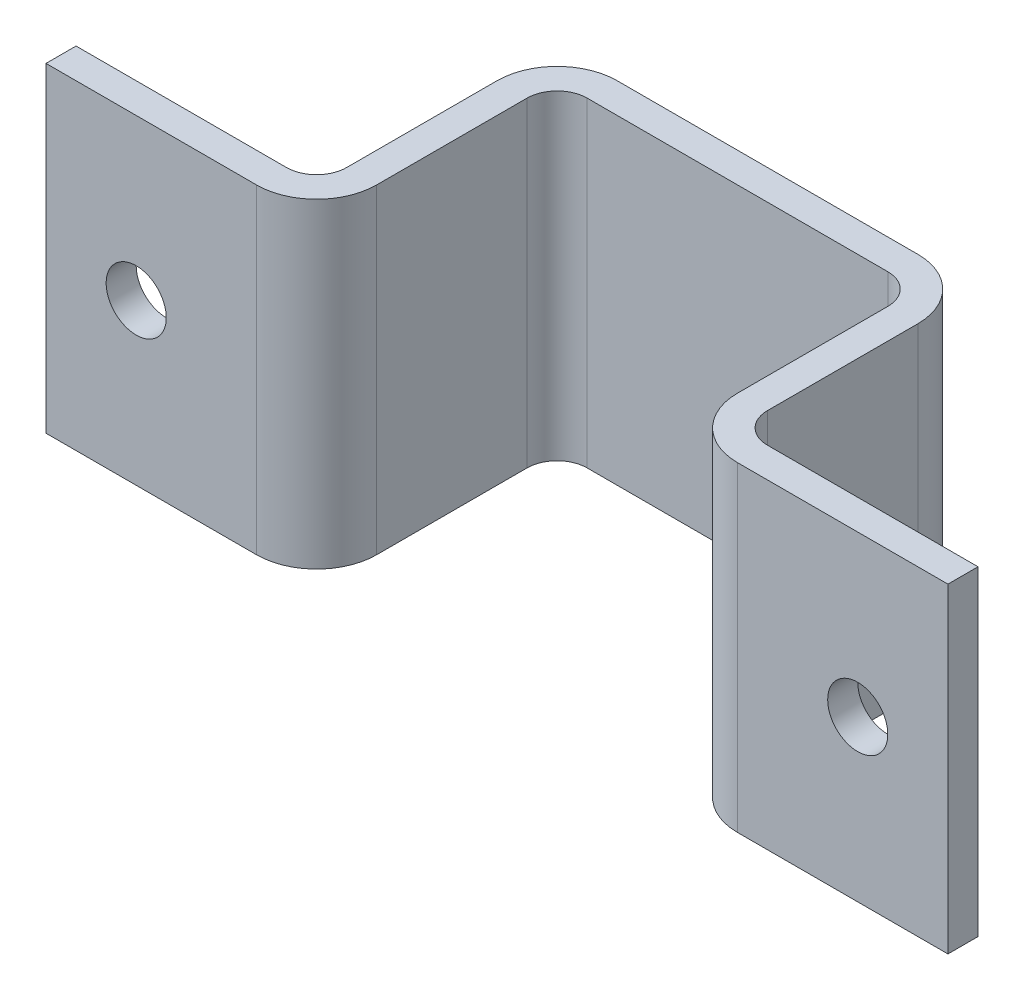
ISO-10303-21;
HEADER;
FILE_DESCRIPTION(('STEP AP214'),'2;1');
FILE_NAME('part.step','',(''),(''),'','','');
FILE_SCHEMA(('AUTOMOTIVE_DESIGN { 1 0 10303 214 1 1 1 1 }'));
ENDSEC;
DATA;
#1=APPLICATION_CONTEXT('core data for automotive mechanical design processes');
#2=APPLICATION_PROTOCOL_DEFINITION('international standard','automotive_design',2000,#1);
#3=PRODUCT_CONTEXT('',#1,'mechanical');
#4=PRODUCT('Part','Part','',(#3));
#5=PRODUCT_RELATED_PRODUCT_CATEGORY('part','',(#4));
#6=PRODUCT_DEFINITION_FORMATION('','',#4);
#7=PRODUCT_DEFINITION_CONTEXT('part definition',#1,'design');
#8=PRODUCT_DEFINITION('design','',#6,#7);
#9=PRODUCT_DEFINITION_SHAPE('','',#8);
#10=(LENGTH_UNIT() NAMED_UNIT(*) SI_UNIT(.MILLI.,.METRE.));
#11=(NAMED_UNIT(*) PLANE_ANGLE_UNIT() SI_UNIT($,.RADIAN.));
#12=(NAMED_UNIT(*) SI_UNIT($,.STERADIAN.) SOLID_ANGLE_UNIT());
#13=UNCERTAINTY_MEASURE_WITH_UNIT(LENGTH_MEASURE(1.E-05),#10,'distance_accuracy_value','');
#14=(GEOMETRIC_REPRESENTATION_CONTEXT(3) GLOBAL_UNCERTAINTY_ASSIGNED_CONTEXT((#13)) GLOBAL_UNIT_ASSIGNED_CONTEXT((#10,
#11,#12)) REPRESENTATION_CONTEXT('',''));
#15=CARTESIAN_POINT('',(0.,0.,0.));
#16=DIRECTION('',(0.,0.,1.));
#17=DIRECTION('',(1.,0.,0.));
#18=AXIS2_PLACEMENT_3D('',#15,#16,#17);
#19=CARTESIAN_POINT('',(-75.,26.6348483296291,-5.));
#20=DIRECTION('',(0.,0.,1.));
#21=DIRECTION('',(1.,0.,0.));
#22=AXIS2_PLACEMENT_3D('',#19,#20,#21);
#23=PLANE('',#22);
#24=CARTESIAN_POINT('',(-60.,0.,-5.));
#25=DIRECTION('',(0.,0.,-1.));
#26=DIRECTION('',(-1.,0.,0.));
#27=AXIS2_PLACEMENT_3D('',#24,#25,#26);
#28=CIRCLE('',#27,5.);
#29=CARTESIAN_POINT('',(-65.,0.,-5.));
#30=VERTEX_POINT('',#29);
#31=EDGE_CURVE('E412',#30,#30,#28,.T.);
#32=ORIENTED_EDGE('',*,*,#31,.F.);
#33=EDGE_LOOP('',(#32));
#34=FACE_BOUND('',#33,.T.);
#35=DIRECTION('',(1.,0.,0.));
#36=VECTOR('',#35,1.);
#37=CARTESIAN_POINT('',(-75.,-26.6348483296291,-5.));
#38=LINE('',#37,#36);
#39=CARTESIAN_POINT('',(-40.,-26.6348483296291,-5.));
#40=VERTEX_POINT('',#39);
#41=CARTESIAN_POINT('',(-75.,-26.6348483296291,-5.));
#42=VERTEX_POINT('',#41);
#43=EDGE_CURVE('E178',#40,#42,#38,.F.);
#44=ORIENTED_EDGE('',*,*,#43,.T.);
#45=DIRECTION('',(0.,-1.,0.));
#46=VECTOR('',#45,1.);
#47=CARTESIAN_POINT('',(-75.,26.6348483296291,-5.));
#48=LINE('',#47,#46);
#49=CARTESIAN_POINT('',(-75.,26.6348483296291,-5.));
#50=VERTEX_POINT('',#49);
#51=EDGE_CURVE('E11',#50,#42,#48,.T.);
#52=ORIENTED_EDGE('',*,*,#51,.F.);
#53=DIRECTION('',(1.,0.,0.));
#54=VECTOR('',#53,1.);
#55=CARTESIAN_POINT('',(-75.,26.6348483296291,-5.));
#56=LINE('',#55,#54);
#57=CARTESIAN_POINT('',(-40.,26.6348483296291,-5.));
#58=VERTEX_POINT('',#57);
#59=EDGE_CURVE('E234',#58,#50,#56,.F.);
#60=ORIENTED_EDGE('',*,*,#59,.F.);
#61=DIRECTION('',(0.,-1.,0.));
#62=VECTOR('',#61,1.);
#63=CARTESIAN_POINT('',(-40.,26.6348483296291,-5.));
#64=LINE('',#63,#62);
#65=EDGE_CURVE('E179',#58,#40,#64,.T.);
#66=ORIENTED_EDGE('',*,*,#65,.T.);
#67=EDGE_LOOP('',(#44,#52,#60,#66));
#68=FACE_BOUND('',#67,.T.);
#69=ADVANCED_FACE('F32',(#34,#68),#23,.F.);
#70=CARTESIAN_POINT('',(-75.,26.6348483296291,0.));
#71=DIRECTION('',(-1.,0.,0.));
#72=DIRECTION('',(0.,0.,1.));
#73=AXIS2_PLACEMENT_3D('',#70,#71,#72);
#74=PLANE('',#73);
#75=DIRECTION('',(0.,0.,-1.));
#76=VECTOR('',#75,1.);
#77=CARTESIAN_POINT('',(-75.,-26.6348483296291,0.));
#78=LINE('',#77,#76);
#79=CARTESIAN_POINT('',(-75.,-26.6348483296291,0.));
#80=VERTEX_POINT('',#79);
#81=EDGE_CURVE('E170',#80,#42,#78,.T.);
#82=ORIENTED_EDGE('',*,*,#81,.F.);
#83=DIRECTION('',(0.,-1.,0.));
#84=VECTOR('',#83,1.);
#85=CARTESIAN_POINT('',(-75.,26.6348483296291,0.));
#86=LINE('',#85,#84);
#87=CARTESIAN_POINT('',(-75.,26.6348483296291,0.));
#88=VERTEX_POINT('',#87);
#89=EDGE_CURVE('E39',#88,#80,#86,.T.);
#90=ORIENTED_EDGE('',*,*,#89,.F.);
#91=DIRECTION('',(0.,0.,-1.));
#92=VECTOR('',#91,1.);
#93=CARTESIAN_POINT('',(-75.,26.6348483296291,0.));
#94=LINE('',#93,#92);
#95=EDGE_CURVE('E173',#88,#50,#94,.T.);
#96=ORIENTED_EDGE('',*,*,#95,.T.);
#97=ORIENTED_EDGE('',*,*,#51,.T.);
#98=EDGE_LOOP('',(#82,#90,#96,#97));
#99=FACE_BOUND('',#98,.T.);
#100=ADVANCED_FACE('F168',(#99),#74,.T.);
#101=CARTESIAN_POINT('',(-75.,26.6348483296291,0.));
#102=DIRECTION('',(0.,0.,1.));
#103=DIRECTION('',(1.,0.,0.));
#104=AXIS2_PLACEMENT_3D('',#101,#102,#103);
#105=PLANE('',#104);
#106=CARTESIAN_POINT('',(-60.,0.,0.));
#107=DIRECTION('',(0.,0.,-1.));
#108=DIRECTION('',(-1.,0.,0.));
#109=AXIS2_PLACEMENT_3D('',#106,#107,#108);
#110=CIRCLE('',#109,5.);
#111=CARTESIAN_POINT('',(-65.,0.,0.));
#112=VERTEX_POINT('',#111);
#113=EDGE_CURVE('E182',#112,#112,#110,.T.);
#114=ORIENTED_EDGE('',*,*,#113,.T.);
#115=EDGE_LOOP('',(#114));
#116=FACE_BOUND('',#115,.T.);
#117=DIRECTION('',(-1.,0.,0.));
#118=VECTOR('',#117,1.);
#119=CARTESIAN_POINT('',(-75.,-26.6348483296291,0.));
#120=LINE('',#119,#118);
#121=CARTESIAN_POINT('',(-40.,-26.6348483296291,0.));
#122=VERTEX_POINT('',#121);
#123=EDGE_CURVE('E187',#122,#80,#120,.T.);
#124=ORIENTED_EDGE('',*,*,#123,.F.);
#125=DIRECTION('',(0.,-1.,0.));
#126=VECTOR('',#125,1.);
#127=CARTESIAN_POINT('',(-40.,26.6348483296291,0.));
#128=LINE('',#127,#126);
#129=CARTESIAN_POINT('',(-40.,26.6348483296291,0.));
#130=VERTEX_POINT('',#129);
#131=EDGE_CURVE('E321',#130,#122,#128,.T.);
#132=ORIENTED_EDGE('',*,*,#131,.F.);
#133=DIRECTION('',(-1.,0.,0.));
#134=VECTOR('',#133,1.);
#135=CARTESIAN_POINT('',(-75.,26.6348483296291,0.));
#136=LINE('',#135,#134);
#137=EDGE_CURVE('E237',#130,#88,#136,.T.);
#138=ORIENTED_EDGE('',*,*,#137,.T.);
#139=ORIENTED_EDGE('',*,*,#89,.T.);
#140=EDGE_LOOP('',(#124,#132,#138,#139));
#141=FACE_BOUND('',#140,.T.);
#142=ADVANCED_FACE('F323',(#116,#141),#105,.T.);
#143=CARTESIAN_POINT('',(-40.,26.6348483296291,-10.));
#144=DIRECTION('',(0.,-1.,0.));
#145=DIRECTION('',(0.,0.,-1.));
#146=AXIS2_PLACEMENT_3D('',#143,#144,#145);
#147=CYLINDRICAL_SURFACE('',#146,10.);
#148=CARTESIAN_POINT('',(-40.,-26.6348483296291,-10.));
#149=DIRECTION('',(0.,-1.,0.));
#150=DIRECTION('',(0.,0.,1.));
#151=AXIS2_PLACEMENT_3D('',#148,#149,#150);
#152=CIRCLE('',#151,10.);
#153=CARTESIAN_POINT('',(-30.,-26.6348483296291,-10.));
#154=VERTEX_POINT('',#153);
#155=EDGE_CURVE('E189',#154,#122,#152,.T.);
#156=ORIENTED_EDGE('',*,*,#155,.F.);
#157=DIRECTION('',(0.,-1.,0.));
#158=VECTOR('',#157,1.);
#159=CARTESIAN_POINT('',(-30.,26.6348483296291,-10.));
#160=LINE('',#159,#158);
#161=CARTESIAN_POINT('',(-30.,26.6348483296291,-10.));
#162=VERTEX_POINT('',#161);
#163=EDGE_CURVE('E319',#162,#154,#160,.T.);
#164=ORIENTED_EDGE('',*,*,#163,.F.);
#165=CARTESIAN_POINT('',(-40.,26.6348483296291,-10.));
#166=DIRECTION('',(0.,-1.,0.));
#167=DIRECTION('',(0.,0.,1.));
#168=AXIS2_PLACEMENT_3D('',#165,#166,#167);
#169=CIRCLE('',#168,10.);
#170=EDGE_CURVE('E240',#162,#130,#169,.T.);
#171=ORIENTED_EDGE('',*,*,#170,.T.);
#172=ORIENTED_EDGE('',*,*,#131,.T.);
#173=EDGE_LOOP('',(#156,#164,#171,#172));
#174=FACE_BOUND('',#173,.T.);
#175=ADVANCED_FACE('F330',(#174),#147,.T.);
#176=CARTESIAN_POINT('',(-30.,26.6348483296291,-10.));
#177=DIRECTION('',(1.,0.,0.));
#178=DIRECTION('',(0.,0.,-1.));
#179=AXIS2_PLACEMENT_3D('',#176,#177,#178);
#180=PLANE('',#179);
#181=DIRECTION('',(0.,0.,1.));
#182=VECTOR('',#181,1.);
#183=CARTESIAN_POINT('',(-30.,-26.6348483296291,-10.));
#184=LINE('',#183,#182);
#185=CARTESIAN_POINT('',(-30.,-26.6348483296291,-35.));
#186=VERTEX_POINT('',#185);
#187=EDGE_CURVE('E194',#186,#154,#184,.T.);
#188=ORIENTED_EDGE('',*,*,#187,.F.);
#189=DIRECTION('',(0.,-1.,0.));
#190=VECTOR('',#189,1.);
#191=CARTESIAN_POINT('',(-30.,26.6348483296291,-35.));
#192=LINE('',#191,#190);
#193=CARTESIAN_POINT('',(-30.,26.6348483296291,-35.));
#194=VERTEX_POINT('',#193);
#195=EDGE_CURVE('E317',#194,#186,#192,.T.);
#196=ORIENTED_EDGE('',*,*,#195,.F.);
#197=DIRECTION('',(0.,0.,1.));
#198=VECTOR('',#197,1.);
#199=CARTESIAN_POINT('',(-30.,26.6348483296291,-10.));
#200=LINE('',#199,#198);
#201=EDGE_CURVE('E243',#194,#162,#200,.T.);
#202=ORIENTED_EDGE('',*,*,#201,.T.);
#203=ORIENTED_EDGE('',*,*,#163,.T.);
#204=EDGE_LOOP('',(#188,#196,#202,#203));
#205=FACE_BOUND('',#204,.T.);
#206=ADVANCED_FACE('F333',(#205),#180,.T.);
#207=CARTESIAN_POINT('',(-25.,26.6348483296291,-35.));
#208=DIRECTION('',(0.,-1.,0.));
#209=DIRECTION('',(0.,0.,-1.));
#210=AXIS2_PLACEMENT_3D('',#207,#208,#209);
#211=CYLINDRICAL_SURFACE('',#210,5.);
#212=CARTESIAN_POINT('',(-25.,-26.6348483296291,-35.));
#213=DIRECTION('',(0.,1.,0.));
#214=DIRECTION('',(0.,0.,-1.));
#215=AXIS2_PLACEMENT_3D('',#212,#213,#214);
#216=CIRCLE('',#215,5.);
#217=CARTESIAN_POINT('',(-25.,-26.6348483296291,-40.));
#218=VERTEX_POINT('',#217);
#219=EDGE_CURVE('E197',#218,#186,#216,.T.);
#220=ORIENTED_EDGE('',*,*,#219,.F.);
#221=DIRECTION('',(0.,-1.,0.));
#222=VECTOR('',#221,1.);
#223=CARTESIAN_POINT('',(-25.,26.6348483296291,-40.));
#224=LINE('',#223,#222);
#225=CARTESIAN_POINT('',(-25.,26.6348483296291,-40.));
#226=VERTEX_POINT('',#225);
#227=EDGE_CURVE('E315',#226,#218,#224,.T.);
#228=ORIENTED_EDGE('',*,*,#227,.F.);
#229=CARTESIAN_POINT('',(-25.,26.6348483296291,-35.));
#230=DIRECTION('',(0.,1.,0.));
#231=DIRECTION('',(0.,0.,-1.));
#232=AXIS2_PLACEMENT_3D('',#229,#230,#231);
#233=CIRCLE('',#232,5.);
#234=EDGE_CURVE('E246',#226,#194,#233,.T.);
#235=ORIENTED_EDGE('',*,*,#234,.T.);
#236=ORIENTED_EDGE('',*,*,#195,.T.);
#237=EDGE_LOOP('',(#220,#228,#235,#236));
#238=FACE_BOUND('',#237,.T.);
#239=ADVANCED_FACE('F338',(#238),#211,.F.);
#240=CARTESIAN_POINT('',(-25.,26.6348483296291,-40.));
#241=DIRECTION('',(0.,0.,1.));
#242=DIRECTION('',(1.,0.,0.));
#243=AXIS2_PLACEMENT_3D('',#240,#241,#242);
#244=PLANE('',#243);
#245=DIRECTION('',(-1.,0.,0.));
#246=VECTOR('',#245,1.);
#247=CARTESIAN_POINT('',(-25.,-26.6348483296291,-40.));
#248=LINE('',#247,#246);
#249=CARTESIAN_POINT('',(25.,-26.6348483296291,-40.));
#250=VERTEX_POINT('',#249);
#251=EDGE_CURVE('E200',#250,#218,#248,.T.);
#252=ORIENTED_EDGE('',*,*,#251,.F.);
#253=DIRECTION('',(0.,-1.,0.));
#254=VECTOR('',#253,1.);
#255=CARTESIAN_POINT('',(25.,26.6348483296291,-40.));
#256=LINE('',#255,#254);
#257=CARTESIAN_POINT('',(25.,26.6348483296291,-40.));
#258=VERTEX_POINT('',#257);
#259=EDGE_CURVE('E313',#258,#250,#256,.T.);
#260=ORIENTED_EDGE('',*,*,#259,.F.);
#261=DIRECTION('',(-1.,0.,0.));
#262=VECTOR('',#261,1.);
#263=CARTESIAN_POINT('',(-25.,26.6348483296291,-40.));
#264=LINE('',#263,#262);
#265=EDGE_CURVE('E249',#258,#226,#264,.T.);
#266=ORIENTED_EDGE('',*,*,#265,.T.);
#267=ORIENTED_EDGE('',*,*,#227,.T.);
#268=EDGE_LOOP('',(#252,#260,#266,#267));
#269=FACE_BOUND('',#268,.T.);
#270=ADVANCED_FACE('F341',(#269),#244,.T.);
#271=CARTESIAN_POINT('',(25.,26.6348483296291,-35.));
#272=DIRECTION('',(0.,-1.,0.));
#273=DIRECTION('',(0.,0.,-1.));
#274=AXIS2_PLACEMENT_3D('',#271,#272,#273);
#275=CYLINDRICAL_SURFACE('',#274,5.);
#276=CARTESIAN_POINT('',(25.,-26.6348483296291,-35.));
#277=DIRECTION('',(0.,1.,0.));
#278=DIRECTION('',(0.,0.,-1.));
#279=AXIS2_PLACEMENT_3D('',#276,#277,#278);
#280=CIRCLE('',#279,5.);
#281=CARTESIAN_POINT('',(30.,-26.6348483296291,-35.));
#282=VERTEX_POINT('',#281);
#283=EDGE_CURVE('E203',#282,#250,#280,.T.);
#284=ORIENTED_EDGE('',*,*,#283,.F.);
#285=DIRECTION('',(0.,-1.,0.));
#286=VECTOR('',#285,1.);
#287=CARTESIAN_POINT('',(30.,26.6348483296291,-35.));
#288=LINE('',#287,#286);
#289=CARTESIAN_POINT('',(30.,26.6348483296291,-35.));
#290=VERTEX_POINT('',#289);
#291=EDGE_CURVE('E311',#290,#282,#288,.T.);
#292=ORIENTED_EDGE('',*,*,#291,.F.);
#293=CARTESIAN_POINT('',(25.,26.6348483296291,-35.));
#294=DIRECTION('',(0.,1.,0.));
#295=DIRECTION('',(0.,0.,-1.));
#296=AXIS2_PLACEMENT_3D('',#293,#294,#295);
#297=CIRCLE('',#296,5.);
#298=EDGE_CURVE('E252',#290,#258,#297,.T.);
#299=ORIENTED_EDGE('',*,*,#298,.T.);
#300=ORIENTED_EDGE('',*,*,#259,.T.);
#301=EDGE_LOOP('',(#284,#292,#299,#300));
#302=FACE_BOUND('',#301,.T.);
#303=ADVANCED_FACE('F346',(#302),#275,.F.);
#304=CARTESIAN_POINT('',(30.,26.6348483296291,-10.));
#305=DIRECTION('',(-1.,0.,0.));
#306=DIRECTION('',(0.,0.,1.));
#307=AXIS2_PLACEMENT_3D('',#304,#305,#306);
#308=PLANE('',#307);
#309=DIRECTION('',(0.,0.,-1.));
#310=VECTOR('',#309,1.);
#311=CARTESIAN_POINT('',(30.,-26.6348483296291,-10.));
#312=LINE('',#311,#310);
#313=CARTESIAN_POINT('',(30.,-26.6348483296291,-10.));
#314=VERTEX_POINT('',#313);
#315=EDGE_CURVE('E206',#314,#282,#312,.T.);
#316=ORIENTED_EDGE('',*,*,#315,.F.);
#317=DIRECTION('',(0.,-1.,0.));
#318=VECTOR('',#317,1.);
#319=CARTESIAN_POINT('',(30.,26.6348483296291,-10.));
#320=LINE('',#319,#318);
#321=CARTESIAN_POINT('',(30.,26.6348483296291,-10.));
#322=VERTEX_POINT('',#321);
#323=EDGE_CURVE('E309',#322,#314,#320,.T.);
#324=ORIENTED_EDGE('',*,*,#323,.F.);
#325=DIRECTION('',(0.,0.,-1.));
#326=VECTOR('',#325,1.);
#327=CARTESIAN_POINT('',(30.,26.6348483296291,-10.));
#328=LINE('',#327,#326);
#329=EDGE_CURVE('E255',#322,#290,#328,.T.);
#330=ORIENTED_EDGE('',*,*,#329,.T.);
#331=ORIENTED_EDGE('',*,*,#291,.T.);
#332=EDGE_LOOP('',(#316,#324,#330,#331));
#333=FACE_BOUND('',#332,.T.);
#334=ADVANCED_FACE('F349',(#333),#308,.T.);
#335=CARTESIAN_POINT('',(40.,26.6348483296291,-10.));
#336=DIRECTION('',(0.,-1.,0.));
#337=DIRECTION('',(0.,0.,-1.));
#338=AXIS2_PLACEMENT_3D('',#335,#336,#337);
#339=CYLINDRICAL_SURFACE('',#338,9.99999999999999);
#340=CARTESIAN_POINT('',(40.,-26.6348483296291,-10.));
#341=DIRECTION('',(0.,-1.,0.));
#342=DIRECTION('',(0.,0.,1.));
#343=AXIS2_PLACEMENT_3D('',#340,#341,#342);
#344=CIRCLE('',#343,9.99999999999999);
#345=CARTESIAN_POINT('',(40.,-26.6348483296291,0.));
#346=VERTEX_POINT('',#345);
#347=EDGE_CURVE('E209',#346,#314,#344,.T.);
#348=ORIENTED_EDGE('',*,*,#347,.F.);
#349=DIRECTION('',(0.,-1.,0.));
#350=VECTOR('',#349,1.);
#351=CARTESIAN_POINT('',(40.,26.6348483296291,0.));
#352=LINE('',#351,#350);
#353=CARTESIAN_POINT('',(40.,26.6348483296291,0.));
#354=VERTEX_POINT('',#353);
#355=EDGE_CURVE('E307',#354,#346,#352,.T.);
#356=ORIENTED_EDGE('',*,*,#355,.F.);
#357=CARTESIAN_POINT('',(40.,26.6348483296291,-10.));
#358=DIRECTION('',(0.,-1.,0.));
#359=DIRECTION('',(0.,0.,1.));
#360=AXIS2_PLACEMENT_3D('',#357,#358,#359);
#361=CIRCLE('',#360,9.99999999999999);
#362=EDGE_CURVE('E258',#354,#322,#361,.T.);
#363=ORIENTED_EDGE('',*,*,#362,.T.);
#364=ORIENTED_EDGE('',*,*,#323,.T.);
#365=EDGE_LOOP('',(#348,#356,#363,#364));
#366=FACE_BOUND('',#365,.T.);
#367=ADVANCED_FACE('F354',(#366),#339,.T.);
#368=CARTESIAN_POINT('',(75.,26.6348483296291,0.));
#369=DIRECTION('',(0.,0.,1.));
#370=DIRECTION('',(1.,0.,0.));
#371=AXIS2_PLACEMENT_3D('',#368,#369,#370);
#372=PLANE('',#371);
#373=CARTESIAN_POINT('',(60.,0.,0.));
#374=DIRECTION('',(0.,0.,-1.));
#375=DIRECTION('',(-1.,0.,0.));
#376=AXIS2_PLACEMENT_3D('',#373,#374,#375);
#377=CIRCLE('',#376,5.);
#378=CARTESIAN_POINT('',(55.,0.,0.));
#379=VERTEX_POINT('',#378);
#380=EDGE_CURVE('E414',#379,#379,#377,.T.);
#381=ORIENTED_EDGE('',*,*,#380,.T.);
#382=EDGE_LOOP('',(#381));
#383=FACE_BOUND('',#382,.T.);
#384=DIRECTION('',(-1.,0.,0.));
#385=VECTOR('',#384,1.);
#386=CARTESIAN_POINT('',(75.,-26.6348483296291,0.));
#387=LINE('',#386,#385);
#388=CARTESIAN_POINT('',(75.,-26.6348483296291,0.));
#389=VERTEX_POINT('',#388);
#390=EDGE_CURVE('E212',#389,#346,#387,.T.);
#391=ORIENTED_EDGE('',*,*,#390,.F.);
#392=DIRECTION('',(0.,-1.,0.));
#393=VECTOR('',#392,1.);
#394=CARTESIAN_POINT('',(75.,26.6348483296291,0.));
#395=LINE('',#394,#393);
#396=CARTESIAN_POINT('',(75.,26.6348483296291,0.));
#397=VERTEX_POINT('',#396);
#398=EDGE_CURVE('E305',#397,#389,#395,.T.);
#399=ORIENTED_EDGE('',*,*,#398,.F.);
#400=DIRECTION('',(-1.,0.,0.));
#401=VECTOR('',#400,1.);
#402=CARTESIAN_POINT('',(75.,26.6348483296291,0.));
#403=LINE('',#402,#401);
#404=EDGE_CURVE('E261',#397,#354,#403,.T.);
#405=ORIENTED_EDGE('',*,*,#404,.T.);
#406=ORIENTED_EDGE('',*,*,#355,.T.);
#407=EDGE_LOOP('',(#391,#399,#405,#406));
#408=FACE_BOUND('',#407,.T.);
#409=ADVANCED_FACE('F357',(#383,#408),#372,.T.);
#410=CARTESIAN_POINT('',(75.,26.6348483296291,-5.00000000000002));
#411=DIRECTION('',(1.,0.,0.));
#412=DIRECTION('',(0.,0.,-1.));
#413=AXIS2_PLACEMENT_3D('',#410,#411,#412);
#414=PLANE('',#413);
#415=DIRECTION('',(0.,0.,1.));
#416=VECTOR('',#415,1.);
#417=CARTESIAN_POINT('',(75.,-26.6348483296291,-5.00000000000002));
#418=LINE('',#417,#416);
#419=CARTESIAN_POINT('',(75.,-26.6348483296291,-5.00000000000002));
#420=VERTEX_POINT('',#419);
#421=EDGE_CURVE('E215',#420,#389,#418,.T.);
#422=ORIENTED_EDGE('',*,*,#421,.F.);
#423=DIRECTION('',(0.,-1.,0.));
#424=VECTOR('',#423,1.);
#425=CARTESIAN_POINT('',(75.,26.6348483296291,-5.00000000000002));
#426=LINE('',#425,#424);
#427=CARTESIAN_POINT('',(75.,26.6348483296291,-5.00000000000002));
#428=VERTEX_POINT('',#427);
#429=EDGE_CURVE('E303',#428,#420,#426,.T.);
#430=ORIENTED_EDGE('',*,*,#429,.F.);
#431=DIRECTION('',(0.,0.,1.));
#432=VECTOR('',#431,1.);
#433=CARTESIAN_POINT('',(75.,26.6348483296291,-5.00000000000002));
#434=LINE('',#433,#432);
#435=EDGE_CURVE('E264',#428,#397,#434,.T.);
#436=ORIENTED_EDGE('',*,*,#435,.T.);
#437=ORIENTED_EDGE('',*,*,#398,.T.);
#438=EDGE_LOOP('',(#422,#430,#436,#437));
#439=FACE_BOUND('',#438,.T.);
#440=ADVANCED_FACE('F361',(#439),#414,.T.);
#441=CARTESIAN_POINT('',(75.,26.6348483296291,-5.00000000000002));
#442=DIRECTION('',(0.,0.,1.));
#443=DIRECTION('',(1.,0.,0.));
#444=AXIS2_PLACEMENT_3D('',#441,#442,#443);
#445=PLANE('',#444);
#446=CARTESIAN_POINT('',(60.,0.,-5.));
#447=DIRECTION('',(0.,0.,-1.));
#448=DIRECTION('',(-1.,0.,0.));
#449=AXIS2_PLACEMENT_3D('',#446,#447,#448);
#450=CIRCLE('',#449,5.);
#451=CARTESIAN_POINT('',(55.,0.,-5.));
#452=VERTEX_POINT('',#451);
#453=EDGE_CURVE('E418',#452,#452,#450,.T.);
#454=ORIENTED_EDGE('',*,*,#453,.F.);
#455=EDGE_LOOP('',(#454));
#456=FACE_BOUND('',#455,.T.);
#457=DIRECTION('',(-1.,0.,0.));
#458=VECTOR('',#457,1.);
#459=CARTESIAN_POINT('',(75.,-26.6348483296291,-5.00000000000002));
#460=LINE('',#459,#458);
#461=CARTESIAN_POINT('',(40.,-26.6348483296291,-5.00000000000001));
#462=VERTEX_POINT('',#461);
#463=EDGE_CURVE('E218',#420,#462,#460,.T.);
#464=ORIENTED_EDGE('',*,*,#463,.T.);
#465=DIRECTION('',(0.,-1.,0.));
#466=VECTOR('',#465,1.);
#467=CARTESIAN_POINT('',(40.,26.6348483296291,-5.00000000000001));
#468=LINE('',#467,#466);
#469=CARTESIAN_POINT('',(40.,26.6348483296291,-5.00000000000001));
#470=VERTEX_POINT('',#469);
#471=EDGE_CURVE('E300',#470,#462,#468,.T.);
#472=ORIENTED_EDGE('',*,*,#471,.F.);
#473=DIRECTION('',(-1.,0.,0.));
#474=VECTOR('',#473,1.);
#475=CARTESIAN_POINT('',(75.,26.6348483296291,-5.00000000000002));
#476=LINE('',#475,#474);
#477=EDGE_CURVE('E267',#428,#470,#476,.T.);
#478=ORIENTED_EDGE('',*,*,#477,.F.);
#479=ORIENTED_EDGE('',*,*,#429,.T.);
#480=EDGE_LOOP('',(#464,#472,#478,#479));
#481=FACE_BOUND('',#480,.T.);
#482=ADVANCED_FACE('F366',(#456,#481),#445,.F.);
#483=CARTESIAN_POINT('',(40.,26.6348483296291,-10.));
#484=DIRECTION('',(0.,-1.,0.));
#485=DIRECTION('',(0.,0.,-1.));
#486=AXIS2_PLACEMENT_3D('',#483,#484,#485);
#487=CYLINDRICAL_SURFACE('',#486,4.99999999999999);
#488=CARTESIAN_POINT('',(40.,-26.6348483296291,-10.));
#489=DIRECTION('',(0.,1.,0.));
#490=DIRECTION('',(1.,0.,0.));
#491=AXIS2_PLACEMENT_3D('',#488,#489,#490);
#492=CIRCLE('',#491,4.99999999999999);
#493=CARTESIAN_POINT('',(35.,-26.6348483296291,-10.));
#494=VERTEX_POINT('',#493);
#495=EDGE_CURVE('E220',#462,#494,#492,.F.);
#496=ORIENTED_EDGE('',*,*,#495,.T.);
#497=DIRECTION('',(0.,-1.,0.));
#498=VECTOR('',#497,1.);
#499=CARTESIAN_POINT('',(35.,26.6348483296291,-10.));
#500=LINE('',#499,#498);
#501=CARTESIAN_POINT('',(35.,26.6348483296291,-10.));
#502=VERTEX_POINT('',#501);
#503=EDGE_CURVE('E297',#502,#494,#500,.T.);
#504=ORIENTED_EDGE('',*,*,#503,.F.);
#505=CARTESIAN_POINT('',(40.,26.6348483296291,-10.));
#506=DIRECTION('',(0.,1.,0.));
#507=DIRECTION('',(1.,0.,0.));
#508=AXIS2_PLACEMENT_3D('',#505,#506,#507);
#509=CIRCLE('',#508,4.99999999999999);
#510=EDGE_CURVE('E269',#470,#502,#509,.F.);
#511=ORIENTED_EDGE('',*,*,#510,.F.);
#512=ORIENTED_EDGE('',*,*,#471,.T.);
#513=EDGE_LOOP('',(#496,#504,#511,#512));
#514=FACE_BOUND('',#513,.T.);
#515=ADVANCED_FACE('F372',(#514),#487,.F.);
#516=CARTESIAN_POINT('',(35.,26.6348483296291,-10.));
#517=DIRECTION('',(-1.,0.,0.));
#518=DIRECTION('',(0.,0.,1.));
#519=AXIS2_PLACEMENT_3D('',#516,#517,#518);
#520=PLANE('',#519);
#521=DIRECTION('',(0.,0.,-1.));
#522=VECTOR('',#521,1.);
#523=CARTESIAN_POINT('',(35.,-26.6348483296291,-10.));
#524=LINE('',#523,#522);
#525=CARTESIAN_POINT('',(35.,-26.6348483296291,-35.));
#526=VERTEX_POINT('',#525);
#527=EDGE_CURVE('E222',#494,#526,#524,.T.);
#528=ORIENTED_EDGE('',*,*,#527,.T.);
#529=DIRECTION('',(0.,-1.,0.));
#530=VECTOR('',#529,1.);
#531=CARTESIAN_POINT('',(35.,26.6348483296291,-35.));
#532=LINE('',#531,#530);
#533=CARTESIAN_POINT('',(35.,26.6348483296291,-35.));
#534=VERTEX_POINT('',#533);
#535=EDGE_CURVE('E294',#534,#526,#532,.T.);
#536=ORIENTED_EDGE('',*,*,#535,.F.);
#537=DIRECTION('',(0.,0.,-1.));
#538=VECTOR('',#537,1.);
#539=CARTESIAN_POINT('',(35.,26.6348483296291,-10.));
#540=LINE('',#539,#538);
#541=EDGE_CURVE('E271',#502,#534,#540,.T.);
#542=ORIENTED_EDGE('',*,*,#541,.F.);
#543=ORIENTED_EDGE('',*,*,#503,.T.);
#544=EDGE_LOOP('',(#528,#536,#542,#543));
#545=FACE_BOUND('',#544,.T.);
#546=ADVANCED_FACE('F376',(#545),#520,.F.);
#547=CARTESIAN_POINT('',(25.,26.6348483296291,-35.));
#548=DIRECTION('',(0.,-1.,0.));
#549=DIRECTION('',(0.,0.,-1.));
#550=AXIS2_PLACEMENT_3D('',#547,#548,#549);
#551=CYLINDRICAL_SURFACE('',#550,9.99999999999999);
#552=CARTESIAN_POINT('',(25.,-26.6348483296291,-35.));
#553=DIRECTION('',(0.,1.,0.));
#554=DIRECTION('',(1.,0.,0.));
#555=AXIS2_PLACEMENT_3D('',#552,#553,#554);
#556=CIRCLE('',#555,9.99999999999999);
#557=CARTESIAN_POINT('',(25.,-26.6348483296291,-45.));
#558=VERTEX_POINT('',#557);
#559=EDGE_CURVE('E224',#526,#558,#556,.T.);
#560=ORIENTED_EDGE('',*,*,#559,.T.);
#561=DIRECTION('',(0.,-1.,0.));
#562=VECTOR('',#561,1.);
#563=CARTESIAN_POINT('',(25.,26.6348483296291,-45.));
#564=LINE('',#563,#562);
#565=CARTESIAN_POINT('',(25.,26.6348483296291,-45.));
#566=VERTEX_POINT('',#565);
#567=EDGE_CURVE('E291',#566,#558,#564,.T.);
#568=ORIENTED_EDGE('',*,*,#567,.F.);
#569=CARTESIAN_POINT('',(25.,26.6348483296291,-35.));
#570=DIRECTION('',(0.,1.,0.));
#571=DIRECTION('',(1.,0.,0.));
#572=AXIS2_PLACEMENT_3D('',#569,#570,#571);
#573=CIRCLE('',#572,9.99999999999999);
#574=EDGE_CURVE('E273',#534,#566,#573,.T.);
#575=ORIENTED_EDGE('',*,*,#574,.F.);
#576=ORIENTED_EDGE('',*,*,#535,.T.);
#577=EDGE_LOOP('',(#560,#568,#575,#576));
#578=FACE_BOUND('',#577,.T.);
#579=ADVANCED_FACE('F381',(#578),#551,.T.);
#580=CARTESIAN_POINT('',(-25.,26.6348483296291,-45.));
#581=DIRECTION('',(0.,0.,1.));
#582=DIRECTION('',(1.,0.,0.));
#583=AXIS2_PLACEMENT_3D('',#580,#581,#582);
#584=PLANE('',#583);
#585=DIRECTION('',(1.,0.,0.));
#586=VECTOR('',#585,1.);
#587=CARTESIAN_POINT('',(-25.,-26.6348483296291,-45.));
#588=LINE('',#587,#586);
#589=CARTESIAN_POINT('',(-25.,-26.6348483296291,-45.));
#590=VERTEX_POINT('',#589);
#591=EDGE_CURVE('E226',#558,#590,#588,.F.);
#592=ORIENTED_EDGE('',*,*,#591,.T.);
#593=DIRECTION('',(0.,-1.,0.));
#594=VECTOR('',#593,1.);
#595=CARTESIAN_POINT('',(-25.,26.6348483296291,-45.));
#596=LINE('',#595,#594);
#597=CARTESIAN_POINT('',(-25.,26.6348483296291,-45.));
#598=VERTEX_POINT('',#597);
#599=EDGE_CURVE('E288',#598,#590,#596,.T.);
#600=ORIENTED_EDGE('',*,*,#599,.F.);
#601=DIRECTION('',(1.,0.,0.));
#602=VECTOR('',#601,1.);
#603=CARTESIAN_POINT('',(-25.,26.6348483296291,-45.));
#604=LINE('',#603,#602);
#605=EDGE_CURVE('E275',#566,#598,#604,.F.);
#606=ORIENTED_EDGE('',*,*,#605,.F.);
#607=ORIENTED_EDGE('',*,*,#567,.T.);
#608=EDGE_LOOP('',(#592,#600,#606,#607));
#609=FACE_BOUND('',#608,.T.);
#610=ADVANCED_FACE('F387',(#609),#584,.F.);
#611=CARTESIAN_POINT('',(-25.,26.6348483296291,-35.));
#612=DIRECTION('',(0.,-1.,0.));
#613=DIRECTION('',(0.,0.,-1.));
#614=AXIS2_PLACEMENT_3D('',#611,#612,#613);
#615=CYLINDRICAL_SURFACE('',#614,9.99999999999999);
#616=CARTESIAN_POINT('',(-25.,-26.6348483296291,-35.));
#617=DIRECTION('',(0.,1.,0.));
#618=DIRECTION('',(1.,0.,0.));
#619=AXIS2_PLACEMENT_3D('',#616,#617,#618);
#620=CIRCLE('',#619,9.99999999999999);
#621=CARTESIAN_POINT('',(-35.,-26.6348483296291,-35.));
#622=VERTEX_POINT('',#621);
#623=EDGE_CURVE('E228',#590,#622,#620,.T.);
#624=ORIENTED_EDGE('',*,*,#623,.T.);
#625=DIRECTION('',(0.,-1.,0.));
#626=VECTOR('',#625,1.);
#627=CARTESIAN_POINT('',(-35.,26.6348483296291,-35.));
#628=LINE('',#627,#626);
#629=CARTESIAN_POINT('',(-35.,26.6348483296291,-35.));
#630=VERTEX_POINT('',#629);
#631=EDGE_CURVE('E285',#630,#622,#628,.T.);
#632=ORIENTED_EDGE('',*,*,#631,.F.);
#633=CARTESIAN_POINT('',(-25.,26.6348483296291,-35.));
#634=DIRECTION('',(0.,1.,0.));
#635=DIRECTION('',(1.,0.,0.));
#636=AXIS2_PLACEMENT_3D('',#633,#634,#635);
#637=CIRCLE('',#636,9.99999999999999);
#638=EDGE_CURVE('E277',#598,#630,#637,.T.);
#639=ORIENTED_EDGE('',*,*,#638,.F.);
#640=ORIENTED_EDGE('',*,*,#599,.T.);
#641=EDGE_LOOP('',(#624,#632,#639,#640));
#642=FACE_BOUND('',#641,.T.);
#643=ADVANCED_FACE('F391',(#642),#615,.T.);
#644=CARTESIAN_POINT('',(-35.,26.6348483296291,-10.));
#645=DIRECTION('',(1.,0.,0.));
#646=DIRECTION('',(0.,0.,-1.));
#647=AXIS2_PLACEMENT_3D('',#644,#645,#646);
#648=PLANE('',#647);
#649=DIRECTION('',(0.,0.,-1.));
#650=VECTOR('',#649,1.);
#651=CARTESIAN_POINT('',(-35.,-26.6348483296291,-10.));
#652=LINE('',#651,#650);
#653=CARTESIAN_POINT('',(-35.,-26.6348483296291,-10.));
#654=VERTEX_POINT('',#653);
#655=EDGE_CURVE('E230',#622,#654,#652,.F.);
#656=ORIENTED_EDGE('',*,*,#655,.T.);
#657=DIRECTION('',(0.,-1.,0.));
#658=VECTOR('',#657,1.);
#659=CARTESIAN_POINT('',(-35.,26.6348483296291,-10.));
#660=LINE('',#659,#658);
#661=CARTESIAN_POINT('',(-35.,26.6348483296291,-10.));
#662=VERTEX_POINT('',#661);
#663=EDGE_CURVE('E282',#662,#654,#660,.T.);
#664=ORIENTED_EDGE('',*,*,#663,.F.);
#665=DIRECTION('',(0.,0.,-1.));
#666=VECTOR('',#665,1.);
#667=CARTESIAN_POINT('',(-35.,26.6348483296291,-10.));
#668=LINE('',#667,#666);
#669=EDGE_CURVE('E51',#630,#662,#668,.F.);
#670=ORIENTED_EDGE('',*,*,#669,.F.);
#671=ORIENTED_EDGE('',*,*,#631,.T.);
#672=EDGE_LOOP('',(#656,#664,#670,#671));
#673=FACE_BOUND('',#672,.T.);
#674=ADVANCED_FACE('F394',(#673),#648,.F.);
#675=CARTESIAN_POINT('',(-40.,26.6348483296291,-10.));
#676=DIRECTION('',(0.,-1.,0.));
#677=DIRECTION('',(0.,0.,-1.));
#678=AXIS2_PLACEMENT_3D('',#675,#676,#677);
#679=CYLINDRICAL_SURFACE('',#678,5.);
#680=CARTESIAN_POINT('',(-40.,-26.6348483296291,-10.));
#681=DIRECTION('',(0.,1.,0.));
#682=DIRECTION('',(1.,0.,0.));
#683=AXIS2_PLACEMENT_3D('',#680,#681,#682);
#684=CIRCLE('',#683,5.);
#685=EDGE_CURVE('E232',#654,#40,#684,.F.);
#686=ORIENTED_EDGE('',*,*,#685,.T.);
#687=ORIENTED_EDGE('',*,*,#65,.F.);
#688=CARTESIAN_POINT('',(-40.,26.6348483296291,-10.));
#689=DIRECTION('',(0.,1.,0.));
#690=DIRECTION('',(1.,0.,0.));
#691=AXIS2_PLACEMENT_3D('',#688,#689,#690);
#692=CIRCLE('',#691,5.);
#693=EDGE_CURVE('E46',#662,#58,#692,.F.);
#694=ORIENTED_EDGE('',*,*,#693,.F.);
#695=ORIENTED_EDGE('',*,*,#663,.T.);
#696=EDGE_LOOP('',(#686,#687,#694,#695));
#697=FACE_BOUND('',#696,.T.);
#698=ADVANCED_FACE('F396',(#697),#679,.F.);
#699=CARTESIAN_POINT('',(-40.,26.6348483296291,-10.));
#700=DIRECTION('',(0.,-1.,0.));
#701=DIRECTION('',(0.,0.,-1.));
#702=AXIS2_PLACEMENT_3D('',#699,#700,#701);
#703=PLANE('',#702);
#704=ORIENTED_EDGE('',*,*,#59,.T.);
#705=ORIENTED_EDGE('',*,*,#95,.F.);
#706=ORIENTED_EDGE('',*,*,#137,.F.);
#707=ORIENTED_EDGE('',*,*,#170,.F.);
#708=ORIENTED_EDGE('',*,*,#201,.F.);
#709=ORIENTED_EDGE('',*,*,#234,.F.);
#710=ORIENTED_EDGE('',*,*,#265,.F.);
#711=ORIENTED_EDGE('',*,*,#298,.F.);
#712=ORIENTED_EDGE('',*,*,#329,.F.);
#713=ORIENTED_EDGE('',*,*,#362,.F.);
#714=ORIENTED_EDGE('',*,*,#404,.F.);
#715=ORIENTED_EDGE('',*,*,#435,.F.);
#716=ORIENTED_EDGE('',*,*,#477,.T.);
#717=ORIENTED_EDGE('',*,*,#510,.T.);
#718=ORIENTED_EDGE('',*,*,#541,.T.);
#719=ORIENTED_EDGE('',*,*,#574,.T.);
#720=ORIENTED_EDGE('',*,*,#605,.T.);
#721=ORIENTED_EDGE('',*,*,#638,.T.);
#722=ORIENTED_EDGE('',*,*,#669,.T.);
#723=ORIENTED_EDGE('',*,*,#693,.T.);
#724=EDGE_LOOP('',(#704,#705,#706,#707,#708,#709,#710,#711,#712,#713,#714,#715,#716,#717,#718,
#719,#720,#721,#722,#723));
#725=FACE_BOUND('',#724,.T.);
#726=ADVANCED_FACE('F325',(#725),#703,.F.);
#727=CARTESIAN_POINT('',(-40.,-26.6348483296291,-10.));
#728=DIRECTION('',(0.,-1.,0.));
#729=DIRECTION('',(0.,0.,-1.));
#730=AXIS2_PLACEMENT_3D('',#727,#728,#729);
#731=PLANE('',#730);
#732=ORIENTED_EDGE('',*,*,#43,.F.);
#733=ORIENTED_EDGE('',*,*,#685,.F.);
#734=ORIENTED_EDGE('',*,*,#655,.F.);
#735=ORIENTED_EDGE('',*,*,#623,.F.);
#736=ORIENTED_EDGE('',*,*,#591,.F.);
#737=ORIENTED_EDGE('',*,*,#559,.F.);
#738=ORIENTED_EDGE('',*,*,#527,.F.);
#739=ORIENTED_EDGE('',*,*,#495,.F.);
#740=ORIENTED_EDGE('',*,*,#463,.F.);
#741=ORIENTED_EDGE('',*,*,#421,.T.);
#742=ORIENTED_EDGE('',*,*,#390,.T.);
#743=ORIENTED_EDGE('',*,*,#347,.T.);
#744=ORIENTED_EDGE('',*,*,#315,.T.);
#745=ORIENTED_EDGE('',*,*,#283,.T.);
#746=ORIENTED_EDGE('',*,*,#251,.T.);
#747=ORIENTED_EDGE('',*,*,#219,.T.);
#748=ORIENTED_EDGE('',*,*,#187,.T.);
#749=ORIENTED_EDGE('',*,*,#155,.T.);
#750=ORIENTED_EDGE('',*,*,#123,.T.);
#751=ORIENTED_EDGE('',*,*,#81,.T.);
#752=EDGE_LOOP('',(#732,#733,#734,#735,#736,#737,#738,#739,#740,#741,#742,#743,#744,#745,#746,
#747,#748,#749,#750,#751));
#753=FACE_BOUND('',#752,.T.);
#754=ADVANCED_FACE('F184',(#753),#731,.T.);
#755=CARTESIAN_POINT('',(-60.,0.,0.));
#756=DIRECTION('',(0.,0.,-1.));
#757=DIRECTION('',(-1.,0.,0.));
#758=AXIS2_PLACEMENT_3D('',#755,#756,#757);
#759=CYLINDRICAL_SURFACE('',#758,5.);
#760=ORIENTED_EDGE('',*,*,#113,.F.);
#761=EDGE_LOOP('',(#760));
#762=FACE_BOUND('',#761,.T.);
#763=ORIENTED_EDGE('',*,*,#31,.T.);
#764=EDGE_LOOP('',(#763));
#765=FACE_BOUND('',#764,.T.);
#766=ADVANCED_FACE('F459',(#762,#765),#759,.F.);
#767=CARTESIAN_POINT('',(60.,0.,0.));
#768=DIRECTION('',(0.,0.,-1.));
#769=DIRECTION('',(-1.,0.,0.));
#770=AXIS2_PLACEMENT_3D('',#767,#768,#769);
#771=CYLINDRICAL_SURFACE('',#770,5.);
#772=ORIENTED_EDGE('',*,*,#380,.F.);
#773=EDGE_LOOP('',(#772));
#774=FACE_BOUND('',#773,.T.);
#775=ORIENTED_EDGE('',*,*,#453,.T.);
#776=EDGE_LOOP('',(#775));
#777=FACE_BOUND('',#776,.T.);
#778=ADVANCED_FACE('F424',(#774,#777),#771,.F.);
#779=CLOSED_SHELL('',(#69,#100,#142,#175,#206,#239,#270,#303,#334,#367,#409,#440,#482,#515,#546,
#579,#610,#643,#674,#698,#726,#754,#766,#778));
#780=MANIFOLD_SOLID_BREP('B2',#779);
#781=ADVANCED_BREP_SHAPE_REPRESENTATION('',(#18,#780),#14);
#782=SHAPE_DEFINITION_REPRESENTATION(#9,#781);
ENDSEC;
END-ISO-10303-21;
